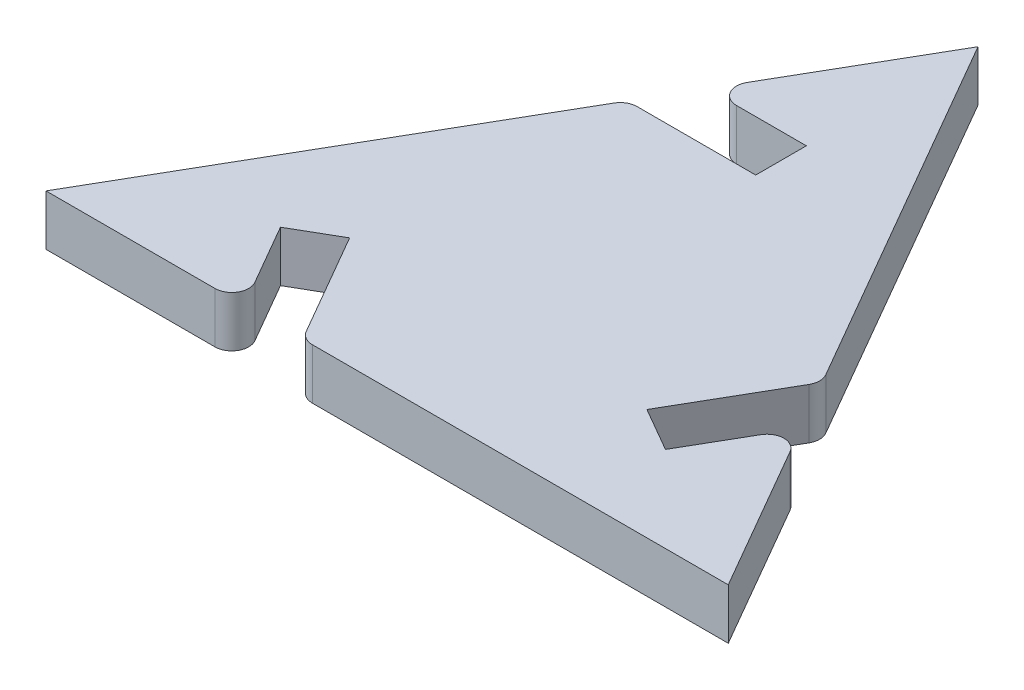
ISO-10303-21;
HEADER;
FILE_DESCRIPTION(('STEP AP214'),'2;1');
FILE_NAME('part.step','',(''),(''),'','','');
FILE_SCHEMA(('AUTOMOTIVE_DESIGN { 1 0 10303 214 1 1 1 1 }'));
ENDSEC;
DATA;
#1=APPLICATION_CONTEXT('core data for automotive mechanical design processes');
#2=APPLICATION_PROTOCOL_DEFINITION('international standard','automotive_design',2000,#1);
#3=PRODUCT_CONTEXT('',#1,'mechanical');
#4=PRODUCT('Part','Part','',(#3));
#5=PRODUCT_RELATED_PRODUCT_CATEGORY('part','',(#4));
#6=PRODUCT_DEFINITION_FORMATION('','',#4);
#7=PRODUCT_DEFINITION_CONTEXT('part definition',#1,'design');
#8=PRODUCT_DEFINITION('design','',#6,#7);
#9=PRODUCT_DEFINITION_SHAPE('','',#8);
#10=(LENGTH_UNIT() NAMED_UNIT(*) SI_UNIT(.MILLI.,.METRE.));
#11=(NAMED_UNIT(*) PLANE_ANGLE_UNIT() SI_UNIT($,.RADIAN.));
#12=(NAMED_UNIT(*) SI_UNIT($,.STERADIAN.) SOLID_ANGLE_UNIT());
#13=UNCERTAINTY_MEASURE_WITH_UNIT(LENGTH_MEASURE(1.E-05),#10,'distance_accuracy_value','');
#14=(GEOMETRIC_REPRESENTATION_CONTEXT(3) GLOBAL_UNCERTAINTY_ASSIGNED_CONTEXT((#13)) GLOBAL_UNIT_ASSIGNED_CONTEXT((#10,
#11,#12)) REPRESENTATION_CONTEXT('',''));
#15=CARTESIAN_POINT('',(0.,0.,0.));
#16=DIRECTION('',(0.,0.,1.));
#17=DIRECTION('',(1.,0.,0.));
#18=AXIS2_PLACEMENT_3D('',#15,#16,#17);
#19=CARTESIAN_POINT('',(40.4145188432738,6.,23.3333333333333));
#20=DIRECTION('',(-0.866025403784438,0.,0.5));
#21=DIRECTION('',(0.5,0.,0.866025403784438));
#22=AXIS2_PLACEMENT_3D('',#19,#20,#21);
#23=PLANE('',#22);
#24=DIRECTION('',(-0.5,0.,-0.866025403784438));
#25=VECTOR('',#24,1.);
#26=CARTESIAN_POINT('',(40.4145188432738,6.,23.3333333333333));
#27=LINE('',#26,#25);
#28=CARTESIAN_POINT('',(24.633611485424,6.,-4.00000000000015));
#29=VERTEX_POINT('',#28);
#30=CARTESIAN_POINT('',(0.,6.,-46.6666666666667));
#31=VERTEX_POINT('',#30);
#32=EDGE_CURVE('E254',#29,#31,#27,.T.);
#33=ORIENTED_EDGE('',*,*,#32,.F.);
#34=DIRECTION('',(0.,-1.,0.));
#35=VECTOR('',#34,1.);
#36=CARTESIAN_POINT('',(24.633611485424,6.,-4.00000000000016));
#37=LINE('',#36,#35);
#38=CARTESIAN_POINT('',(24.633611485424,0.,-4.00000000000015));
#39=VERTEX_POINT('',#38);
#40=EDGE_CURVE('E317',#29,#39,#37,.T.);
#41=ORIENTED_EDGE('',*,*,#40,.T.);
#42=DIRECTION('',(-0.5,0.,-0.866025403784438));
#43=VECTOR('',#42,1.);
#44=CARTESIAN_POINT('',(40.4145188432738,0.,23.3333333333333));
#45=LINE('',#44,#43);
#46=CARTESIAN_POINT('',(0.,0.,-46.6666666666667));
#47=VERTEX_POINT('',#46);
#48=EDGE_CURVE('E248',#39,#47,#45,.T.);
#49=ORIENTED_EDGE('',*,*,#48,.T.);
#50=DIRECTION('',(0.,-1.,0.));
#51=VECTOR('',#50,1.);
#52=CARTESIAN_POINT('',(0.,6.,-46.6666666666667));
#53=LINE('',#52,#51);
#54=EDGE_CURVE('E276',#31,#47,#53,.T.);
#55=ORIENTED_EDGE('',*,*,#54,.F.);
#56=EDGE_LOOP('',(#33,#41,#49,#55));
#57=FACE_BOUND('',#56,.T.);
#58=ADVANCED_FACE('F33',(#57),#23,.F.);
#59=CARTESIAN_POINT('',(-40.4145188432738,6.,23.3333333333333));
#60=DIRECTION('',(0.,0.,-1.));
#61=DIRECTION('',(-1.,0.,0.));
#62=AXIS2_PLACEMENT_3D('',#59,#60,#61);
#63=PLANE('',#62);
#64=DIRECTION('',(1.,0.,0.));
#65=VECTOR('',#64,1.);
#66=CARTESIAN_POINT('',(-40.4145188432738,6.,23.3333333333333));
#67=LINE('',#66,#65);
#68=CARTESIAN_POINT('',(-8.85270412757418,6.,23.3333333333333));
#69=VERTEX_POINT('',#68);
#70=CARTESIAN_POINT('',(40.4145188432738,6.,23.3333333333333));
#71=VERTEX_POINT('',#70);
#72=EDGE_CURVE('E257',#69,#71,#67,.T.);
#73=ORIENTED_EDGE('',*,*,#72,.F.);
#74=DIRECTION('',(0.,-1.,0.));
#75=VECTOR('',#74,1.);
#76=CARTESIAN_POINT('',(-8.85270412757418,6.,23.3333333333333));
#77=LINE('',#76,#75);
#78=CARTESIAN_POINT('',(-8.85270412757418,0.,23.3333333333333));
#79=VERTEX_POINT('',#78);
#80=EDGE_CURVE('E41',#69,#79,#77,.T.);
#81=ORIENTED_EDGE('',*,*,#80,.T.);
#82=DIRECTION('',(1.,0.,0.));
#83=VECTOR('',#82,1.);
#84=CARTESIAN_POINT('',(-40.4145188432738,0.,23.3333333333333));
#85=LINE('',#84,#83);
#86=CARTESIAN_POINT('',(40.4145188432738,0.,23.3333333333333));
#87=VERTEX_POINT('',#86);
#88=EDGE_CURVE('E267',#79,#87,#85,.T.);
#89=ORIENTED_EDGE('',*,*,#88,.T.);
#90=DIRECTION('',(0.,-1.,0.));
#91=VECTOR('',#90,1.);
#92=CARTESIAN_POINT('',(40.4145188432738,6.,23.3333333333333));
#93=LINE('',#92,#91);
#94=EDGE_CURVE('E260',#71,#87,#93,.T.);
#95=ORIENTED_EDGE('',*,*,#94,.F.);
#96=EDGE_LOOP('',(#73,#81,#89,#95));
#97=FACE_BOUND('',#96,.T.);
#98=ADVANCED_FACE('F331',(#97),#63,.F.);
#99=CARTESIAN_POINT('',(0.,6.,-46.6666666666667));
#100=DIRECTION('',(0.866025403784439,0.,0.5));
#101=DIRECTION('',(0.5,0.,-0.866025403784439));
#102=AXIS2_PLACEMENT_3D('',#99,#100,#101);
#103=PLANE('',#102);
#104=DIRECTION('',(-0.5,0.,0.866025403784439));
#105=VECTOR('',#104,1.);
#106=CARTESIAN_POINT('',(0.,6.,-46.6666666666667));
#107=LINE('',#106,#105);
#108=CARTESIAN_POINT('',(-15.7809073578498,6.,-19.3333333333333));
#109=VERTEX_POINT('',#108);
#110=CARTESIAN_POINT('',(-40.4145188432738,6.,23.3333333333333));
#111=VERTEX_POINT('',#110);
#112=EDGE_CURVE('E253',#109,#111,#107,.T.);
#113=ORIENTED_EDGE('',*,*,#112,.F.);
#114=DIRECTION('',(0.,-1.,0.));
#115=VECTOR('',#114,1.);
#116=CARTESIAN_POINT('',(-15.7809073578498,6.,-19.3333333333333));
#117=LINE('',#116,#115);
#118=CARTESIAN_POINT('',(-15.7809073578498,0.,-19.3333333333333));
#119=VERTEX_POINT('',#118);
#120=EDGE_CURVE('E308',#109,#119,#117,.T.);
#121=ORIENTED_EDGE('',*,*,#120,.T.);
#122=DIRECTION('',(-0.5,0.,0.866025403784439));
#123=VECTOR('',#122,1.);
#124=CARTESIAN_POINT('',(0.,0.,-46.6666666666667));
#125=LINE('',#124,#123);
#126=CARTESIAN_POINT('',(-40.4145188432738,0.,23.3333333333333));
#127=VERTEX_POINT('',#126);
#128=EDGE_CURVE('E263',#119,#127,#125,.T.);
#129=ORIENTED_EDGE('',*,*,#128,.T.);
#130=DIRECTION('',(0.,-1.,0.));
#131=VECTOR('',#130,1.);
#132=CARTESIAN_POINT('',(-40.4145188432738,6.,23.3333333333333));
#133=LINE('',#132,#131);
#134=EDGE_CURVE('E273',#111,#127,#133,.T.);
#135=ORIENTED_EDGE('',*,*,#134,.F.);
#136=EDGE_LOOP('',(#113,#121,#129,#135));
#137=FACE_BOUND('',#136,.T.);
#138=ADVANCED_FACE('F393',(#137),#103,.F.);
#139=CARTESIAN_POINT('',(30.4071141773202,0.,5.9999999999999));
#140=VERTEX_POINT('',#139);
#141=EDGE_CURVE('E261',#87,#140,#45,.T.);
#142=ORIENTED_EDGE('',*,*,#141,.T.);
#143=DIRECTION('',(0.,1.,0.));
#144=VECTOR('',#143,1.);
#145=CARTESIAN_POINT('',(30.4071141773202,6.,5.9999999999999));
#146=LINE('',#145,#144);
#147=CARTESIAN_POINT('',(30.4071141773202,6.,5.9999999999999));
#148=VERTEX_POINT('',#147);
#149=EDGE_CURVE('E313',#140,#148,#146,.T.);
#150=ORIENTED_EDGE('',*,*,#149,.T.);
#151=EDGE_CURVE('E250',#71,#148,#27,.T.);
#152=ORIENTED_EDGE('',*,*,#151,.F.);
#153=ORIENTED_EDGE('',*,*,#94,.T.);
#154=EDGE_LOOP('',(#142,#150,#152,#153));
#155=FACE_BOUND('',#154,.T.);
#156=ADVANCED_FACE('F339',(#155),#23,.F.);
#157=CARTESIAN_POINT('',(-10.0074046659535,0.,-29.3333333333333));
#158=VERTEX_POINT('',#157);
#159=EDGE_CURVE('E264',#47,#158,#125,.T.);
#160=ORIENTED_EDGE('',*,*,#159,.T.);
#161=DIRECTION('',(0.,1.,0.));
#162=VECTOR('',#161,1.);
#163=CARTESIAN_POINT('',(-10.0074046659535,6.,-29.3333333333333));
#164=LINE('',#163,#162);
#165=CARTESIAN_POINT('',(-10.0074046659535,6.,-29.3333333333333));
#166=VERTEX_POINT('',#165);
#167=EDGE_CURVE('E281',#158,#166,#164,.T.);
#168=ORIENTED_EDGE('',*,*,#167,.T.);
#169=EDGE_CURVE('E255',#31,#166,#107,.T.);
#170=ORIENTED_EDGE('',*,*,#169,.F.);
#171=ORIENTED_EDGE('',*,*,#54,.T.);
#172=EDGE_LOOP('',(#160,#168,#170,#171));
#173=FACE_BOUND('',#172,.T.);
#174=ADVANCED_FACE('F367',(#173),#103,.F.);
#175=CARTESIAN_POINT('',(-20.3997095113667,0.,23.3333333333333));
#176=VERTEX_POINT('',#175);
#177=EDGE_CURVE('E268',#127,#176,#85,.T.);
#178=ORIENTED_EDGE('',*,*,#177,.T.);
#179=DIRECTION('',(0.,1.,0.));
#180=VECTOR('',#179,1.);
#181=CARTESIAN_POINT('',(-20.3997095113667,6.,23.3333333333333));
#182=LINE('',#181,#180);
#183=CARTESIAN_POINT('',(-20.3997095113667,6.,23.3333333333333));
#184=VERTEX_POINT('',#183);
#185=EDGE_CURVE('E322',#176,#184,#182,.T.);
#186=ORIENTED_EDGE('',*,*,#185,.T.);
#187=EDGE_CURVE('E258',#111,#184,#67,.T.);
#188=ORIENTED_EDGE('',*,*,#187,.F.);
#189=ORIENTED_EDGE('',*,*,#134,.T.);
#190=EDGE_LOOP('',(#178,#186,#188,#189));
#191=FACE_BOUND('',#190,.T.);
#192=ADVANCED_FACE('F399',(#191),#63,.F.);
#193=CARTESIAN_POINT('',(0.,6.,0.));
#194=DIRECTION('',(0.,1.,0.));
#195=DIRECTION('',(0.,0.,1.));
#196=AXIS2_PLACEMENT_3D('',#193,#194,#195);
#197=PLANE('',#196);
#198=ORIENTED_EDGE('',*,*,#169,.T.);
#199=CARTESIAN_POINT('',(-8.27535385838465,6.,-28.3333333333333));
#200=DIRECTION('',(0.,1.,0.));
#201=DIRECTION('',(0.,0.,1.));
#202=AXIS2_PLACEMENT_3D('',#199,#200,#201);
#203=CIRCLE('',#202,2.);
#204=CARTESIAN_POINT('',(-8.27535385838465,6.,-26.3333333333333));
#205=VERTEX_POINT('',#204);
#206=EDGE_CURVE('E293',#166,#205,#203,.T.);
#207=ORIENTED_EDGE('',*,*,#206,.T.);
#208=DIRECTION('',(-1.,0.,0.));
#209=VECTOR('',#208,1.);
#210=CARTESIAN_POINT('',(0.,6.,-26.3333333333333));
#211=LINE('',#210,#209);
#212=CARTESIAN_POINT('',(0.,6.,-26.3333333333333));
#213=VERTEX_POINT('',#212);
#214=EDGE_CURVE('E241',#213,#205,#211,.T.);
#215=ORIENTED_EDGE('',*,*,#214,.F.);
#216=DIRECTION('',(0.,0.,-1.));
#217=VECTOR('',#216,1.);
#218=CARTESIAN_POINT('',(0.,6.,-26.3333333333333));
#219=LINE('',#218,#217);
#220=CARTESIAN_POINT('',(0.,6.,-20.3333333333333));
#221=VERTEX_POINT('',#220);
#222=EDGE_CURVE('E212',#221,#213,#219,.T.);
#223=ORIENTED_EDGE('',*,*,#222,.F.);
#224=DIRECTION('',(1.,0.,0.));
#225=VECTOR('',#224,1.);
#226=CARTESIAN_POINT('',(0.,6.,-20.3333333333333));
#227=LINE('',#226,#225);
#228=CARTESIAN_POINT('',(-14.0488565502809,6.,-20.3333333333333));
#229=VERTEX_POINT('',#228);
#230=EDGE_CURVE('E235',#229,#221,#227,.T.);
#231=ORIENTED_EDGE('',*,*,#230,.F.);
#232=CARTESIAN_POINT('',(-14.0488565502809,6.,-18.3333333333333));
#233=DIRECTION('',(0.,1.,0.));
#234=DIRECTION('',(0.,0.,1.));
#235=AXIS2_PLACEMENT_3D('',#232,#233,#234);
#236=CIRCLE('',#235,2.);
#237=EDGE_CURVE('E291',#229,#109,#236,.T.);
#238=ORIENTED_EDGE('',*,*,#237,.T.);
#239=ORIENTED_EDGE('',*,*,#112,.T.);
#240=ORIENTED_EDGE('',*,*,#187,.T.);
#241=CARTESIAN_POINT('',(-20.3997095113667,6.,21.3333333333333));
#242=DIRECTION('',(0.,1.,0.));
#243=DIRECTION('',(0.,0.,1.));
#244=AXIS2_PLACEMENT_3D('',#241,#242,#243);
#245=CIRCLE('',#244,2.);
#246=CARTESIAN_POINT('',(-18.6676587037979,6.,20.3333333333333));
#247=VERTEX_POINT('',#246);
#248=EDGE_CURVE('E203',#184,#247,#245,.T.);
#249=ORIENTED_EDGE('',*,*,#248,.T.);
#250=DIRECTION('',(0.500000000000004,0.,0.866025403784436));
#251=VECTOR('',#250,1.);
#252=CARTESIAN_POINT('',(-22.8053356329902,6.,13.1666666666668));
#253=LINE('',#252,#251);
#254=CARTESIAN_POINT('',(-22.8053356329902,6.,13.1666666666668));
#255=VERTEX_POINT('',#254);
#256=EDGE_CURVE('E194',#255,#247,#253,.T.);
#257=ORIENTED_EDGE('',*,*,#256,.F.);
#258=DIRECTION('',(-0.866025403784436,0.,0.500000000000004));
#259=VECTOR('',#258,1.);
#260=CARTESIAN_POINT('',(-22.8053356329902,6.,13.1666666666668));
#261=LINE('',#260,#259);
#262=CARTESIAN_POINT('',(-17.6091832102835,6.,10.1666666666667));
#263=VERTEX_POINT('',#262);
#264=EDGE_CURVE('E178',#263,#255,#261,.T.);
#265=ORIENTED_EDGE('',*,*,#264,.F.);
#266=DIRECTION('',(-0.500000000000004,0.,-0.866025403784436));
#267=VECTOR('',#266,1.);
#268=CARTESIAN_POINT('',(-17.6091832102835,6.,10.1666666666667));
#269=LINE('',#268,#267);
#270=CARTESIAN_POINT('',(-10.584754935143,6.,22.3333333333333));
#271=VERTEX_POINT('',#270);
#272=EDGE_CURVE('E204',#271,#263,#269,.T.);
#273=ORIENTED_EDGE('',*,*,#272,.F.);
#274=CARTESIAN_POINT('',(-8.85270412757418,6.,21.3333333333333));
#275=DIRECTION('',(0.,1.,0.));
#276=DIRECTION('',(0.,0.,1.));
#277=AXIS2_PLACEMENT_3D('',#274,#275,#276);
#278=CIRCLE('',#277,2.);
#279=EDGE_CURVE('E284',#271,#69,#278,.T.);
#280=ORIENTED_EDGE('',*,*,#279,.T.);
#281=ORIENTED_EDGE('',*,*,#72,.T.);
#282=ORIENTED_EDGE('',*,*,#151,.T.);
#283=CARTESIAN_POINT('',(28.6750633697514,6.,6.9999999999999));
#284=DIRECTION('',(0.,1.,0.));
#285=DIRECTION('',(0.,0.,1.));
#286=AXIS2_PLACEMENT_3D('',#283,#284,#285);
#287=CIRCLE('',#286,2.);
#288=CARTESIAN_POINT('',(26.9430125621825,6.,5.99999999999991));
#289=VERTEX_POINT('',#288);
#290=EDGE_CURVE('E289',#148,#289,#287,.T.);
#291=ORIENTED_EDGE('',*,*,#290,.T.);
#292=DIRECTION('',(0.499999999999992,0.,-0.866025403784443));
#293=VECTOR('',#292,1.);
#294=CARTESIAN_POINT('',(22.8053356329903,6.,13.1666666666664));
#295=LINE('',#294,#293);
#296=CARTESIAN_POINT('',(22.8053356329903,6.,13.1666666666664));
#297=VERTEX_POINT('',#296);
#298=EDGE_CURVE('E226',#297,#289,#295,.T.);
#299=ORIENTED_EDGE('',*,*,#298,.F.);
#300=DIRECTION('',(0.866025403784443,0.,0.499999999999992));
#301=VECTOR('',#300,1.);
#302=CARTESIAN_POINT('',(22.8053356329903,6.,13.1666666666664));
#303=LINE('',#302,#301);
#304=CARTESIAN_POINT('',(17.6091832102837,6.,10.1666666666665));
#305=VERTEX_POINT('',#304);
#306=EDGE_CURVE('E213',#305,#297,#303,.T.);
#307=ORIENTED_EDGE('',*,*,#306,.F.);
#308=DIRECTION('',(-0.499999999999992,0.,0.866025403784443));
#309=VECTOR('',#308,1.);
#310=CARTESIAN_POINT('',(17.6091832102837,6.,10.1666666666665));
#311=LINE('',#310,#309);
#312=CARTESIAN_POINT('',(24.633611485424,6.,-2.00000000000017));
#313=VERTEX_POINT('',#312);
#314=EDGE_CURVE('E228',#313,#305,#311,.T.);
#315=ORIENTED_EDGE('',*,*,#314,.F.);
#316=CARTESIAN_POINT('',(22.9015606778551,6.,-3.00000000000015));
#317=DIRECTION('',(0.,1.,0.));
#318=DIRECTION('',(0.,0.,1.));
#319=AXIS2_PLACEMENT_3D('',#316,#317,#318);
#320=CIRCLE('',#319,2.);
#321=EDGE_CURVE('E287',#313,#29,#320,.T.);
#322=ORIENTED_EDGE('',*,*,#321,.T.);
#323=ORIENTED_EDGE('',*,*,#32,.T.);
#324=EDGE_LOOP('',(#198,#207,#215,#223,#231,#238,#239,#240,#249,#257,#265,#273,#280,#281,#282,
#291,#299,#307,#315,#322,#323));
#325=FACE_BOUND('',#324,.T.);
#326=ADVANCED_FACE('F201',(#325),#197,.T.);
#327=CARTESIAN_POINT('',(0.,0.,0.));
#328=DIRECTION('',(0.,1.,0.));
#329=DIRECTION('',(0.,0.,1.));
#330=AXIS2_PLACEMENT_3D('',#327,#328,#329);
#331=PLANE('',#330);
#332=DIRECTION('',(-1.,0.,0.));
#333=VECTOR('',#332,1.);
#334=CARTESIAN_POINT('',(0.,0.,-26.3333333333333));
#335=LINE('',#334,#333);
#336=CARTESIAN_POINT('',(0.,0.,-26.3333333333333));
#337=VERTEX_POINT('',#336);
#338=CARTESIAN_POINT('',(-8.27535385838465,0.,-26.3333333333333));
#339=VERTEX_POINT('',#338);
#340=EDGE_CURVE('E234',#337,#339,#335,.T.);
#341=ORIENTED_EDGE('',*,*,#340,.T.);
#342=CARTESIAN_POINT('',(-8.27535385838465,0.,-28.3333333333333));
#343=DIRECTION('',(0.,1.,0.));
#344=DIRECTION('',(0.,0.,1.));
#345=AXIS2_PLACEMENT_3D('',#342,#343,#344);
#346=CIRCLE('',#345,2.);
#347=EDGE_CURVE('E306',#339,#158,#346,.F.);
#348=ORIENTED_EDGE('',*,*,#347,.T.);
#349=ORIENTED_EDGE('',*,*,#159,.F.);
#350=ORIENTED_EDGE('',*,*,#48,.F.);
#351=CARTESIAN_POINT('',(22.9015606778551,0.,-3.00000000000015));
#352=DIRECTION('',(0.,1.,0.));
#353=DIRECTION('',(0.,0.,1.));
#354=AXIS2_PLACEMENT_3D('',#351,#352,#353);
#355=CIRCLE('',#354,2.);
#356=CARTESIAN_POINT('',(24.633611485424,0.,-2.00000000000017));
#357=VERTEX_POINT('',#356);
#358=EDGE_CURVE('E301',#39,#357,#355,.F.);
#359=ORIENTED_EDGE('',*,*,#358,.T.);
#360=DIRECTION('',(-0.499999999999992,0.,0.866025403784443));
#361=VECTOR('',#360,1.);
#362=CARTESIAN_POINT('',(17.6091832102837,0.,10.1666666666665));
#363=LINE('',#362,#361);
#364=CARTESIAN_POINT('',(17.6091832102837,0.,10.1666666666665));
#365=VERTEX_POINT('',#364);
#366=EDGE_CURVE('E189',#357,#365,#363,.T.);
#367=ORIENTED_EDGE('',*,*,#366,.T.);
#368=DIRECTION('',(0.866025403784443,0.,0.499999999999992));
#369=VECTOR('',#368,1.);
#370=CARTESIAN_POINT('',(22.8053356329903,0.,13.1666666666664));
#371=LINE('',#370,#369);
#372=CARTESIAN_POINT('',(22.8053356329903,0.,13.1666666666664));
#373=VERTEX_POINT('',#372);
#374=EDGE_CURVE('E218',#365,#373,#371,.T.);
#375=ORIENTED_EDGE('',*,*,#374,.T.);
#376=DIRECTION('',(0.499999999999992,0.,-0.866025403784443));
#377=VECTOR('',#376,1.);
#378=CARTESIAN_POINT('',(22.8053356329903,0.,13.1666666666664));
#379=LINE('',#378,#377);
#380=CARTESIAN_POINT('',(26.9430125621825,0.,5.99999999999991));
#381=VERTEX_POINT('',#380);
#382=EDGE_CURVE('E224',#373,#381,#379,.T.);
#383=ORIENTED_EDGE('',*,*,#382,.T.);
#384=CARTESIAN_POINT('',(28.6750633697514,0.,6.9999999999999));
#385=DIRECTION('',(0.,1.,0.));
#386=DIRECTION('',(0.,0.,1.));
#387=AXIS2_PLACEMENT_3D('',#384,#385,#386);
#388=CIRCLE('',#387,2.);
#389=EDGE_CURVE('E48',#381,#140,#388,.F.);
#390=ORIENTED_EDGE('',*,*,#389,.T.);
#391=ORIENTED_EDGE('',*,*,#141,.F.);
#392=ORIENTED_EDGE('',*,*,#88,.F.);
#393=CARTESIAN_POINT('',(-8.85270412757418,0.,21.3333333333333));
#394=DIRECTION('',(0.,1.,0.));
#395=DIRECTION('',(0.,0.,1.));
#396=AXIS2_PLACEMENT_3D('',#393,#394,#395);
#397=CIRCLE('',#396,2.);
#398=CARTESIAN_POINT('',(-10.584754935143,0.,22.3333333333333));
#399=VERTEX_POINT('',#398);
#400=EDGE_CURVE('E297',#79,#399,#397,.F.);
#401=ORIENTED_EDGE('',*,*,#400,.T.);
#402=DIRECTION('',(-0.500000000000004,0.,-0.866025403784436));
#403=VECTOR('',#402,1.);
#404=CARTESIAN_POINT('',(-17.6091832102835,0.,10.1666666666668));
#405=LINE('',#404,#403);
#406=CARTESIAN_POINT('',(-17.6091832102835,0.,10.1666666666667));
#407=VERTEX_POINT('',#406);
#408=EDGE_CURVE('E206',#399,#407,#405,.T.);
#409=ORIENTED_EDGE('',*,*,#408,.T.);
#410=DIRECTION('',(-0.866025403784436,0.,0.500000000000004));
#411=VECTOR('',#410,1.);
#412=CARTESIAN_POINT('',(-22.8053356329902,0.,13.1666666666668));
#413=LINE('',#412,#411);
#414=CARTESIAN_POINT('',(-22.8053356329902,0.,13.1666666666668));
#415=VERTEX_POINT('',#414);
#416=EDGE_CURVE('E198',#407,#415,#413,.T.);
#417=ORIENTED_EDGE('',*,*,#416,.T.);
#418=DIRECTION('',(0.500000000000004,0.,0.866025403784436));
#419=VECTOR('',#418,1.);
#420=CARTESIAN_POINT('',(-22.8053356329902,0.,13.1666666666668));
#421=LINE('',#420,#419);
#422=CARTESIAN_POINT('',(-18.6676587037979,0.,20.3333333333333));
#423=VERTEX_POINT('',#422);
#424=EDGE_CURVE('E197',#415,#423,#421,.T.);
#425=ORIENTED_EDGE('',*,*,#424,.T.);
#426=CARTESIAN_POINT('',(-20.3997095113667,0.,21.3333333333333));
#427=DIRECTION('',(0.,1.,0.));
#428=DIRECTION('',(0.,0.,1.));
#429=AXIS2_PLACEMENT_3D('',#426,#427,#428);
#430=CIRCLE('',#429,2.);
#431=EDGE_CURVE('E299',#423,#176,#430,.F.);
#432=ORIENTED_EDGE('',*,*,#431,.T.);
#433=ORIENTED_EDGE('',*,*,#177,.F.);
#434=ORIENTED_EDGE('',*,*,#128,.F.);
#435=CARTESIAN_POINT('',(-14.0488565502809,0.,-18.3333333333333));
#436=DIRECTION('',(0.,1.,0.));
#437=DIRECTION('',(0.,0.,1.));
#438=AXIS2_PLACEMENT_3D('',#435,#436,#437);
#439=CIRCLE('',#438,2.);
#440=CARTESIAN_POINT('',(-14.0488565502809,0.,-20.3333333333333));
#441=VERTEX_POINT('',#440);
#442=EDGE_CURVE('E304',#119,#441,#439,.F.);
#443=ORIENTED_EDGE('',*,*,#442,.T.);
#444=DIRECTION('',(1.,0.,0.));
#445=VECTOR('',#444,1.);
#446=CARTESIAN_POINT('',(0.,0.,-20.3333333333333));
#447=LINE('',#446,#445);
#448=CARTESIAN_POINT('',(0.,0.,-20.3333333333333));
#449=VERTEX_POINT('',#448);
#450=EDGE_CURVE('E279',#441,#449,#447,.T.);
#451=ORIENTED_EDGE('',*,*,#450,.T.);
#452=DIRECTION('',(0.,0.,-1.));
#453=VECTOR('',#452,1.);
#454=CARTESIAN_POINT('',(0.,0.,-26.3333333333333));
#455=LINE('',#454,#453);
#456=EDGE_CURVE('E231',#449,#337,#455,.T.);
#457=ORIENTED_EDGE('',*,*,#456,.T.);
#458=EDGE_LOOP('',(#341,#348,#349,#350,#359,#367,#375,#383,#390,#391,#392,#401,#409,#417,#425,
#432,#433,#434,#443,#451,#457));
#459=FACE_BOUND('',#458,.T.);
#460=ADVANCED_FACE('F335',(#459),#331,.F.);
#461=CARTESIAN_POINT('',(0.,0.,-20.3333333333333));
#462=DIRECTION('',(0.,0.,1.));
#463=DIRECTION('',(1.,0.,0.));
#464=AXIS2_PLACEMENT_3D('',#461,#462,#463);
#465=PLANE('',#464);
#466=ORIENTED_EDGE('',*,*,#450,.F.);
#467=DIRECTION('',(0.,-1.,0.));
#468=VECTOR('',#467,1.);
#469=CARTESIAN_POINT('',(-14.0488565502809,0.,-20.3333333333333));
#470=LINE('',#469,#468);
#471=EDGE_CURVE('E311',#441,#229,#470,.F.);
#472=ORIENTED_EDGE('',*,*,#471,.T.);
#473=ORIENTED_EDGE('',*,*,#230,.T.);
#474=DIRECTION('',(0.,1.,0.));
#475=VECTOR('',#474,1.);
#476=CARTESIAN_POINT('',(0.,0.,-20.3333333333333));
#477=LINE('',#476,#475);
#478=EDGE_CURVE('E245',#449,#221,#477,.T.);
#479=ORIENTED_EDGE('',*,*,#478,.F.);
#480=EDGE_LOOP('',(#466,#472,#473,#479));
#481=FACE_BOUND('',#480,.T.);
#482=ADVANCED_FACE('F430',(#481),#465,.F.);
#483=CARTESIAN_POINT('',(0.,0.,-26.3333333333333));
#484=DIRECTION('',(0.,0.,-1.));
#485=DIRECTION('',(-1.,0.,0.));
#486=AXIS2_PLACEMENT_3D('',#483,#484,#485);
#487=PLANE('',#486);
#488=ORIENTED_EDGE('',*,*,#214,.T.);
#489=DIRECTION('',(0.,1.,0.));
#490=VECTOR('',#489,1.);
#491=CARTESIAN_POINT('',(-8.27535385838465,0.,-26.3333333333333));
#492=LINE('',#491,#490);
#493=EDGE_CURVE('E295',#205,#339,#492,.F.);
#494=ORIENTED_EDGE('',*,*,#493,.T.);
#495=ORIENTED_EDGE('',*,*,#340,.F.);
#496=DIRECTION('',(0.,1.,0.));
#497=VECTOR('',#496,1.);
#498=CARTESIAN_POINT('',(0.,0.,-26.3333333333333));
#499=LINE('',#498,#497);
#500=EDGE_CURVE('E238',#337,#213,#499,.T.);
#501=ORIENTED_EDGE('',*,*,#500,.T.);
#502=EDGE_LOOP('',(#488,#494,#495,#501));
#503=FACE_BOUND('',#502,.T.);
#504=ADVANCED_FACE('F374',(#503),#487,.F.);
#505=CARTESIAN_POINT('',(0.,0.,-26.3333333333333));
#506=DIRECTION('',(1.,0.,0.));
#507=DIRECTION('',(0.,0.,-1.));
#508=AXIS2_PLACEMENT_3D('',#505,#506,#507);
#509=PLANE('',#508);
#510=ORIENTED_EDGE('',*,*,#222,.T.);
#511=ORIENTED_EDGE('',*,*,#500,.F.);
#512=ORIENTED_EDGE('',*,*,#456,.F.);
#513=ORIENTED_EDGE('',*,*,#478,.T.);
#514=EDGE_LOOP('',(#510,#511,#512,#513));
#515=FACE_BOUND('',#514,.T.);
#516=ADVANCED_FACE('F382',(#515),#509,.F.);
#517=CARTESIAN_POINT('',(17.6091832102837,0.,10.1666666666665));
#518=DIRECTION('',(-0.866025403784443,0.,-0.499999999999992));
#519=DIRECTION('',(-0.499999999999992,0.,0.866025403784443));
#520=AXIS2_PLACEMENT_3D('',#517,#518,#519);
#521=PLANE('',#520);
#522=ORIENTED_EDGE('',*,*,#366,.F.);
#523=DIRECTION('',(0.,-1.,0.));
#524=VECTOR('',#523,1.);
#525=CARTESIAN_POINT('',(24.633611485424,0.,-2.00000000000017));
#526=LINE('',#525,#524);
#527=EDGE_CURVE('E320',#357,#313,#526,.F.);
#528=ORIENTED_EDGE('',*,*,#527,.T.);
#529=ORIENTED_EDGE('',*,*,#314,.T.);
#530=DIRECTION('',(0.,1.,0.));
#531=VECTOR('',#530,1.);
#532=CARTESIAN_POINT('',(17.6091832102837,0.,10.1666666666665));
#533=LINE('',#532,#531);
#534=EDGE_CURVE('E221',#365,#305,#533,.T.);
#535=ORIENTED_EDGE('',*,*,#534,.F.);
#536=EDGE_LOOP('',(#522,#528,#529,#535));
#537=FACE_BOUND('',#536,.T.);
#538=ADVANCED_FACE('F355',(#537),#521,.F.);
#539=CARTESIAN_POINT('',(22.8053356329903,0.,13.1666666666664));
#540=DIRECTION('',(0.866025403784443,0.,0.499999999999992));
#541=DIRECTION('',(0.499999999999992,0.,-0.866025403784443));
#542=AXIS2_PLACEMENT_3D('',#539,#540,#541);
#543=PLANE('',#542);
#544=ORIENTED_EDGE('',*,*,#298,.T.);
#545=DIRECTION('',(0.,1.,0.));
#546=VECTOR('',#545,1.);
#547=CARTESIAN_POINT('',(26.9430125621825,0.,5.99999999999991));
#548=LINE('',#547,#546);
#549=EDGE_CURVE('E56',#289,#381,#548,.F.);
#550=ORIENTED_EDGE('',*,*,#549,.T.);
#551=ORIENTED_EDGE('',*,*,#382,.F.);
#552=DIRECTION('',(0.,1.,0.));
#553=VECTOR('',#552,1.);
#554=CARTESIAN_POINT('',(22.8053356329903,0.,13.1666666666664));
#555=LINE('',#554,#553);
#556=EDGE_CURVE('E215',#373,#297,#555,.T.);
#557=ORIENTED_EDGE('',*,*,#556,.T.);
#558=EDGE_LOOP('',(#544,#550,#551,#557));
#559=FACE_BOUND('',#558,.T.);
#560=ADVANCED_FACE('F345',(#559),#543,.F.);
#561=CARTESIAN_POINT('',(22.8053356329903,0.,13.1666666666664));
#562=DIRECTION('',(-0.499999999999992,0.,0.866025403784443));
#563=DIRECTION('',(0.866025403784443,0.,0.499999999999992));
#564=AXIS2_PLACEMENT_3D('',#561,#562,#563);
#565=PLANE('',#564);
#566=ORIENTED_EDGE('',*,*,#306,.T.);
#567=ORIENTED_EDGE('',*,*,#556,.F.);
#568=ORIENTED_EDGE('',*,*,#374,.F.);
#569=ORIENTED_EDGE('',*,*,#534,.T.);
#570=EDGE_LOOP('',(#566,#567,#568,#569));
#571=FACE_BOUND('',#570,.T.);
#572=ADVANCED_FACE('F349',(#571),#565,.F.);
#573=CARTESIAN_POINT('',(-17.6091832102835,0.,10.1666666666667));
#574=DIRECTION('',(0.866025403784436,0.,-0.500000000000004));
#575=DIRECTION('',(-0.500000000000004,0.,-0.866025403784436));
#576=AXIS2_PLACEMENT_3D('',#573,#574,#575);
#577=PLANE('',#576);
#578=ORIENTED_EDGE('',*,*,#408,.F.);
#579=DIRECTION('',(0.,-1.,0.));
#580=VECTOR('',#579,1.);
#581=CARTESIAN_POINT('',(-10.584754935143,0.,22.3333333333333));
#582=LINE('',#581,#580);
#583=EDGE_CURVE('E11',#399,#271,#582,.F.);
#584=ORIENTED_EDGE('',*,*,#583,.T.);
#585=ORIENTED_EDGE('',*,*,#272,.T.);
#586=DIRECTION('',(0.,1.,0.));
#587=VECTOR('',#586,1.);
#588=CARTESIAN_POINT('',(-17.6091832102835,0.,10.1666666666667));
#589=LINE('',#588,#587);
#590=EDGE_CURVE('E185',#407,#263,#589,.T.);
#591=ORIENTED_EDGE('',*,*,#590,.F.);
#592=EDGE_LOOP('',(#578,#584,#585,#591));
#593=FACE_BOUND('',#592,.T.);
#594=ADVANCED_FACE('F405',(#593),#577,.F.);
#595=CARTESIAN_POINT('',(-22.8053356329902,0.,13.1666666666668));
#596=DIRECTION('',(-0.866025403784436,0.,0.500000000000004));
#597=DIRECTION('',(0.500000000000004,0.,0.866025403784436));
#598=AXIS2_PLACEMENT_3D('',#595,#596,#597);
#599=PLANE('',#598);
#600=ORIENTED_EDGE('',*,*,#256,.T.);
#601=DIRECTION('',(0.,1.,0.));
#602=VECTOR('',#601,1.);
#603=CARTESIAN_POINT('',(-18.6676587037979,0.,20.3333333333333));
#604=LINE('',#603,#602);
#605=EDGE_CURVE('E325',#247,#423,#604,.F.);
#606=ORIENTED_EDGE('',*,*,#605,.T.);
#607=ORIENTED_EDGE('',*,*,#424,.F.);
#608=DIRECTION('',(0.,1.,0.));
#609=VECTOR('',#608,1.);
#610=CARTESIAN_POINT('',(-22.8053356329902,0.,13.1666666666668));
#611=LINE('',#610,#609);
#612=EDGE_CURVE('E182',#415,#255,#611,.T.);
#613=ORIENTED_EDGE('',*,*,#612,.T.);
#614=EDGE_LOOP('',(#600,#606,#607,#613));
#615=FACE_BOUND('',#614,.T.);
#616=ADVANCED_FACE('F193',(#615),#599,.F.);
#617=CARTESIAN_POINT('',(-22.8053356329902,0.,13.1666666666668));
#618=DIRECTION('',(-0.500000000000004,0.,-0.866025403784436));
#619=DIRECTION('',(-0.866025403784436,0.,0.500000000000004));
#620=AXIS2_PLACEMENT_3D('',#617,#618,#619);
#621=PLANE('',#620);
#622=ORIENTED_EDGE('',*,*,#264,.T.);
#623=ORIENTED_EDGE('',*,*,#612,.F.);
#624=ORIENTED_EDGE('',*,*,#416,.F.);
#625=ORIENTED_EDGE('',*,*,#590,.T.);
#626=EDGE_LOOP('',(#622,#623,#624,#625));
#627=FACE_BOUND('',#626,.T.);
#628=ADVANCED_FACE('F180',(#627),#621,.F.);
#629=CARTESIAN_POINT('',(-8.27535385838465,6.,-28.3333333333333));
#630=DIRECTION('',(0.,1.,0.));
#631=DIRECTION('',(0.,0.,1.));
#632=AXIS2_PLACEMENT_3D('',#629,#630,#631);
#633=CYLINDRICAL_SURFACE('',#632,2.);
#634=ORIENTED_EDGE('',*,*,#347,.F.);
#635=ORIENTED_EDGE('',*,*,#493,.F.);
#636=ORIENTED_EDGE('',*,*,#206,.F.);
#637=ORIENTED_EDGE('',*,*,#167,.F.);
#638=EDGE_LOOP('',(#634,#635,#636,#637));
#639=FACE_BOUND('',#638,.T.);
#640=ADVANCED_FACE('F377',(#639),#633,.T.);
#641=CARTESIAN_POINT('',(-14.0488565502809,6.,-18.3333333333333));
#642=DIRECTION('',(0.,-1.,0.));
#643=DIRECTION('',(0.,0.,-1.));
#644=AXIS2_PLACEMENT_3D('',#641,#642,#643);
#645=CYLINDRICAL_SURFACE('',#644,2.);
#646=ORIENTED_EDGE('',*,*,#237,.F.);
#647=ORIENTED_EDGE('',*,*,#471,.F.);
#648=ORIENTED_EDGE('',*,*,#442,.F.);
#649=ORIENTED_EDGE('',*,*,#120,.F.);
#650=EDGE_LOOP('',(#646,#647,#648,#649));
#651=FACE_BOUND('',#650,.T.);
#652=ADVANCED_FACE('F390',(#651),#645,.T.);
#653=CARTESIAN_POINT('',(28.6750633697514,6.,6.9999999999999));
#654=DIRECTION('',(0.,1.,0.));
#655=DIRECTION('',(0.,0.,1.));
#656=AXIS2_PLACEMENT_3D('',#653,#654,#655);
#657=CYLINDRICAL_SURFACE('',#656,2.);
#658=ORIENTED_EDGE('',*,*,#389,.F.);
#659=ORIENTED_EDGE('',*,*,#549,.F.);
#660=ORIENTED_EDGE('',*,*,#290,.F.);
#661=ORIENTED_EDGE('',*,*,#149,.F.);
#662=EDGE_LOOP('',(#658,#659,#660,#661));
#663=FACE_BOUND('',#662,.T.);
#664=ADVANCED_FACE('F342',(#663),#657,.T.);
#665=CARTESIAN_POINT('',(22.9015606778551,6.,-3.00000000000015));
#666=DIRECTION('',(0.,-1.,0.));
#667=DIRECTION('',(0.,0.,-1.));
#668=AXIS2_PLACEMENT_3D('',#665,#666,#667);
#669=CYLINDRICAL_SURFACE('',#668,2.);
#670=ORIENTED_EDGE('',*,*,#321,.F.);
#671=ORIENTED_EDGE('',*,*,#527,.F.);
#672=ORIENTED_EDGE('',*,*,#358,.F.);
#673=ORIENTED_EDGE('',*,*,#40,.F.);
#674=EDGE_LOOP('',(#670,#671,#672,#673));
#675=FACE_BOUND('',#674,.T.);
#676=ADVANCED_FACE('F359',(#675),#669,.T.);
#677=CARTESIAN_POINT('',(-20.3997095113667,6.,21.3333333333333));
#678=DIRECTION('',(0.,1.,0.));
#679=DIRECTION('',(0.,0.,1.));
#680=AXIS2_PLACEMENT_3D('',#677,#678,#679);
#681=CYLINDRICAL_SURFACE('',#680,2.);
#682=ORIENTED_EDGE('',*,*,#431,.F.);
#683=ORIENTED_EDGE('',*,*,#605,.F.);
#684=ORIENTED_EDGE('',*,*,#248,.F.);
#685=ORIENTED_EDGE('',*,*,#185,.F.);
#686=EDGE_LOOP('',(#682,#683,#684,#685));
#687=FACE_BOUND('',#686,.T.);
#688=ADVANCED_FACE('F402',(#687),#681,.T.);
#689=CARTESIAN_POINT('',(-8.85270412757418,6.,21.3333333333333));
#690=DIRECTION('',(0.,-1.,0.));
#691=DIRECTION('',(0.,0.,-1.));
#692=AXIS2_PLACEMENT_3D('',#689,#690,#691);
#693=CYLINDRICAL_SURFACE('',#692,2.);
#694=ORIENTED_EDGE('',*,*,#279,.F.);
#695=ORIENTED_EDGE('',*,*,#583,.F.);
#696=ORIENTED_EDGE('',*,*,#400,.F.);
#697=ORIENTED_EDGE('',*,*,#80,.F.);
#698=EDGE_LOOP('',(#694,#695,#696,#697));
#699=FACE_BOUND('',#698,.T.);
#700=ADVANCED_FACE('F35',(#699),#693,.T.);
#701=CLOSED_SHELL('',(#58,#98,#138,#156,#174,#192,#326,#460,#482,#504,#516,#538,#560,#572,#594,
#616,#628,#640,#652,#664,#676,#688,#700));
#702=MANIFOLD_SOLID_BREP('B2',#701);
#703=ADVANCED_BREP_SHAPE_REPRESENTATION('',(#18,#702),#14);
#704=SHAPE_DEFINITION_REPRESENTATION(#9,#703);
ENDSEC;
END-ISO-10303-21;
